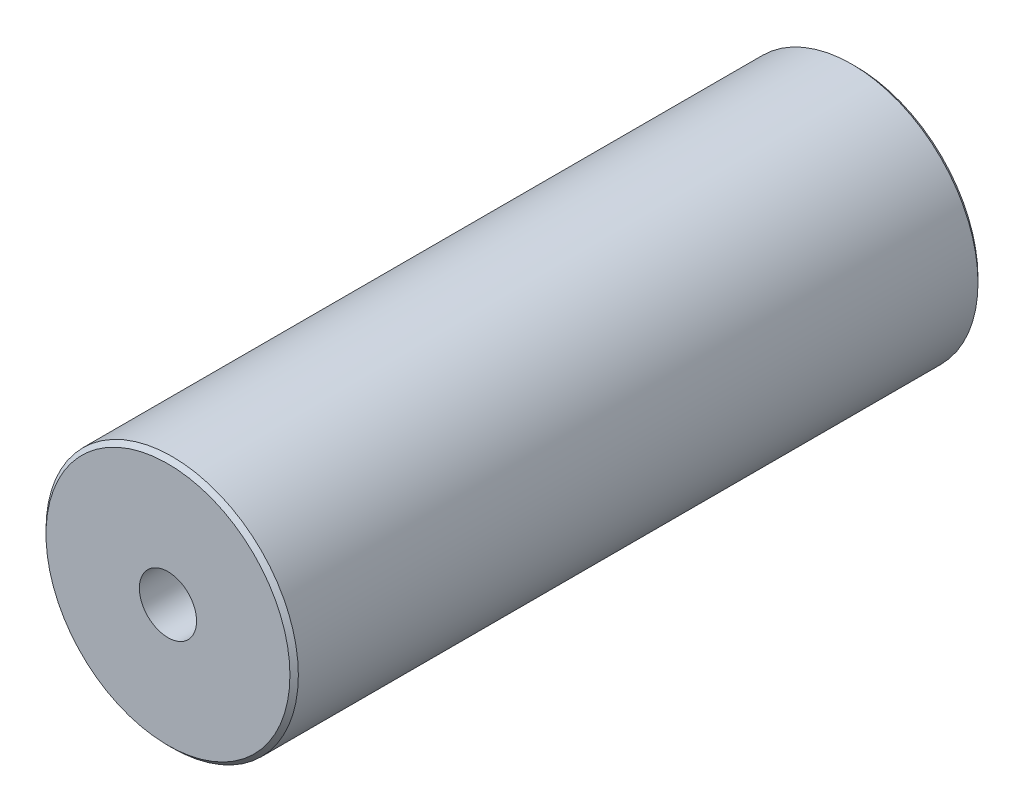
ISO-10303-21;
HEADER;
FILE_DESCRIPTION(('STEP AP214'),'2;1');
FILE_NAME('part.step','',(''),(''),'','','');
FILE_SCHEMA(('AUTOMOTIVE_DESIGN { 1 0 10303 214 1 1 1 1 }'));
ENDSEC;
DATA;
#1=APPLICATION_CONTEXT('core data for automotive mechanical design processes');
#2=APPLICATION_PROTOCOL_DEFINITION('international standard','automotive_design',2000,#1);
#3=PRODUCT_CONTEXT('',#1,'mechanical');
#4=PRODUCT('Part','Part','',(#3));
#5=PRODUCT_RELATED_PRODUCT_CATEGORY('part','',(#4));
#6=PRODUCT_DEFINITION_FORMATION('','',#4);
#7=PRODUCT_DEFINITION_CONTEXT('part definition',#1,'design');
#8=PRODUCT_DEFINITION('design','',#6,#7);
#9=PRODUCT_DEFINITION_SHAPE('','',#8);
#10=(LENGTH_UNIT() NAMED_UNIT(*) SI_UNIT(.MILLI.,.METRE.));
#11=(NAMED_UNIT(*) PLANE_ANGLE_UNIT() SI_UNIT($,.RADIAN.));
#12=(NAMED_UNIT(*) SI_UNIT($,.STERADIAN.) SOLID_ANGLE_UNIT());
#13=UNCERTAINTY_MEASURE_WITH_UNIT(LENGTH_MEASURE(1.E-05),#10,'distance_accuracy_value','');
#14=(GEOMETRIC_REPRESENTATION_CONTEXT(3) GLOBAL_UNCERTAINTY_ASSIGNED_CONTEXT((#13)) GLOBAL_UNIT_ASSIGNED_CONTEXT((#10,
#11,#12)) REPRESENTATION_CONTEXT('',''));
#15=CARTESIAN_POINT('',(0.,0.,0.));
#16=DIRECTION('',(0.,0.,1.));
#17=DIRECTION('',(1.,0.,0.));
#18=AXIS2_PLACEMENT_3D('',#15,#16,#17);
#19=CARTESIAN_POINT('',(0.,0.,40.9));
#20=DIRECTION('',(0.,0.,-1.));
#21=DIRECTION('',(-1.,0.,0.));
#22=AXIS2_PLACEMENT_3D('',#19,#20,#21);
#23=CYLINDRICAL_SURFACE('',#22,15.);
#24=CARTESIAN_POINT('',(0.,0.,40.4));
#25=DIRECTION('',(0.,0.,1.));
#26=DIRECTION('',(1.,0.,0.));
#27=AXIS2_PLACEMENT_3D('',#24,#25,#26);
#28=CIRCLE('',#27,15.);
#29=CARTESIAN_POINT('',(15.,0.,40.4));
#30=VERTEX_POINT('',#29);
#31=EDGE_CURVE('E355',#30,#30,#28,.F.);
#32=ORIENTED_EDGE('',*,*,#31,.T.);
#33=EDGE_LOOP('',(#32));
#34=FACE_BOUND('',#33,.T.);
#35=CARTESIAN_POINT('',(0.,0.,-40.4));
#36=DIRECTION('',(0.,0.,1.));
#37=DIRECTION('',(1.,0.,0.));
#38=AXIS2_PLACEMENT_3D('',#35,#36,#37);
#39=CIRCLE('',#38,15.);
#40=CARTESIAN_POINT('',(15.,0.,-40.4));
#41=VERTEX_POINT('',#40);
#42=EDGE_CURVE('E384',#41,#41,#39,.T.);
#43=ORIENTED_EDGE('',*,*,#42,.T.);
#44=EDGE_LOOP('',(#43));
#45=FACE_BOUND('',#44,.T.);
#46=ADVANCED_FACE('F348',(#34,#45),#23,.T.);
#47=CARTESIAN_POINT('',(0.,0.,40.9));
#48=DIRECTION('',(0.,0.,1.));
#49=DIRECTION('',(1.,0.,0.));
#50=AXIS2_PLACEMENT_3D('',#47,#48,#49);
#51=PLANE('',#50);
#52=CARTESIAN_POINT('',(0.,0.,40.9));
#53=DIRECTION('',(0.,0.,1.));
#54=DIRECTION('',(1.,0.,0.));
#55=AXIS2_PLACEMENT_3D('',#52,#53,#54);
#56=CIRCLE('',#55,3.4);
#57=CARTESIAN_POINT('',(3.4,0.,40.9));
#58=VERTEX_POINT('',#57);
#59=EDGE_CURVE('E378',#58,#58,#56,.T.);
#60=ORIENTED_EDGE('',*,*,#59,.F.);
#61=EDGE_LOOP('',(#60));
#62=FACE_BOUND('',#61,.T.);
#63=CARTESIAN_POINT('',(0.,0.,40.9));
#64=DIRECTION('',(0.,0.,1.));
#65=DIRECTION('',(1.,0.,0.));
#66=AXIS2_PLACEMENT_3D('',#63,#64,#65);
#67=CIRCLE('',#66,14.5);
#68=CARTESIAN_POINT('',(14.5,0.,40.9));
#69=VERTEX_POINT('',#68);
#70=EDGE_CURVE('E381',#69,#69,#67,.T.);
#71=ORIENTED_EDGE('',*,*,#70,.T.);
#72=EDGE_LOOP('',(#71));
#73=FACE_BOUND('',#72,.T.);
#74=ADVANCED_FACE('F399',(#62,#73),#51,.T.);
#75=CARTESIAN_POINT('',(0.,0.,-40.9));
#76=DIRECTION('',(0.,0.,1.));
#77=DIRECTION('',(1.,0.,0.));
#78=AXIS2_PLACEMENT_3D('',#75,#76,#77);
#79=PLANE('',#78);
#80=CARTESIAN_POINT('',(0.,0.,-40.9));
#81=DIRECTION('',(0.,0.,-1.));
#82=DIRECTION('',(-1.,0.,0.));
#83=AXIS2_PLACEMENT_3D('',#80,#81,#82);
#84=CIRCLE('',#83,3.39999999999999);
#85=CARTESIAN_POINT('',(-3.39999999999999,0.,-40.9));
#86=VERTEX_POINT('',#85);
#87=EDGE_CURVE('E370',#86,#86,#84,.T.);
#88=ORIENTED_EDGE('',*,*,#87,.F.);
#89=EDGE_LOOP('',(#88));
#90=FACE_BOUND('',#89,.T.);
#91=CARTESIAN_POINT('',(0.,0.,-40.9));
#92=DIRECTION('',(0.,0.,1.));
#93=DIRECTION('',(1.,0.,0.));
#94=AXIS2_PLACEMENT_3D('',#91,#92,#93);
#95=CIRCLE('',#94,14.5);
#96=CARTESIAN_POINT('',(14.5,0.,-40.9));
#97=VERTEX_POINT('',#96);
#98=EDGE_CURVE('E11',#97,#97,#95,.F.);
#99=ORIENTED_EDGE('',*,*,#98,.T.);
#100=EDGE_LOOP('',(#99));
#101=FACE_BOUND('',#100,.T.);
#102=ADVANCED_FACE('F395',(#90,#101),#79,.F.);
#103=CARTESIAN_POINT('',(0.,0.,40.9));
#104=DIRECTION('',(0.,0.,-1.));
#105=DIRECTION('',(-1.,0.,0.));
#106=AXIS2_PLACEMENT_3D('',#103,#104,#105);
#107=CONICAL_SURFACE('',#106,14.5,0.78539816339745);
#108=ORIENTED_EDGE('',*,*,#31,.F.);
#109=EDGE_LOOP('',(#108));
#110=FACE_BOUND('',#109,.T.);
#111=ORIENTED_EDGE('',*,*,#70,.F.);
#112=EDGE_LOOP('',(#111));
#113=FACE_BOUND('',#112,.T.);
#114=ADVANCED_FACE('F391',(#110,#113),#107,.T.);
#115=CARTESIAN_POINT('',(0.,0.,-40.4));
#116=DIRECTION('',(0.,0.,1.));
#117=DIRECTION('',(1.,0.,0.));
#118=AXIS2_PLACEMENT_3D('',#115,#116,#117);
#119=CONICAL_SURFACE('',#118,15.,0.78539816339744);
#120=ORIENTED_EDGE('',*,*,#98,.F.);
#121=EDGE_LOOP('',(#120));
#122=FACE_BOUND('',#121,.T.);
#123=ORIENTED_EDGE('',*,*,#42,.F.);
#124=EDGE_LOOP('',(#123));
#125=FACE_BOUND('',#124,.T.);
#126=ADVANCED_FACE('F394',(#122,#125),#119,.T.);
#127=CARTESIAN_POINT('',(0.,0.,40.9));
#128=DIRECTION('',(0.,0.,1.));
#129=DIRECTION('',(1.,0.,0.));
#130=AXIS2_PLACEMENT_3D('',#127,#128,#129);
#131=CYLINDRICAL_SURFACE('',#130,3.4);
#132=CARTESIAN_POINT('',(0.,0.,18.65));
#133=DIRECTION('',(0.,0.,1.));
#134=DIRECTION('',(1.,0.,0.));
#135=AXIS2_PLACEMENT_3D('',#132,#133,#134);
#136=CIRCLE('',#135,3.4);
#137=CARTESIAN_POINT('',(3.4,0.,18.65));
#138=VERTEX_POINT('',#137);
#139=EDGE_CURVE('E373',#138,#138,#136,.T.);
#140=ORIENTED_EDGE('',*,*,#139,.F.);
#141=EDGE_LOOP('',(#140));
#142=FACE_BOUND('',#141,.T.);
#143=ORIENTED_EDGE('',*,*,#59,.T.);
#144=EDGE_LOOP('',(#143));
#145=FACE_BOUND('',#144,.T.);
#146=ADVANCED_FACE('F413',(#142,#145),#131,.F.);
#147=CARTESIAN_POINT('',(0.,0.,18.65));
#148=DIRECTION('',(0.,0.,1.));
#149=DIRECTION('',(1.,0.,0.));
#150=AXIS2_PLACEMENT_3D('',#147,#148,#149);
#151=CONICAL_SURFACE('',#150,3.4,1.02974425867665);
#152=CARTESIAN_POINT('',(0.,0.,16.6070738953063));
#153=VERTEX_POINT('',#152);
#154=VERTEX_LOOP('',#153);
#155=FACE_BOUND('',#154,.T.);
#156=ORIENTED_EDGE('',*,*,#139,.T.);
#157=EDGE_LOOP('',(#156));
#158=FACE_BOUND('',#157,.T.);
#159=ADVANCED_FACE('F417',(#155,#158),#151,.F.);
#160=CARTESIAN_POINT('',(0.,0.,-40.9));
#161=DIRECTION('',(0.,0.,-1.));
#162=DIRECTION('',(-1.,0.,0.));
#163=AXIS2_PLACEMENT_3D('',#160,#161,#162);
#164=CYLINDRICAL_SURFACE('',#163,3.39999999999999);
#165=CARTESIAN_POINT('',(0.,0.,-18.65));
#166=DIRECTION('',(0.,0.,-1.));
#167=DIRECTION('',(-1.,0.,0.));
#168=AXIS2_PLACEMENT_3D('',#165,#166,#167);
#169=CIRCLE('',#168,3.39999999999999);
#170=CARTESIAN_POINT('',(-3.39999999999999,0.,-18.65));
#171=VERTEX_POINT('',#170);
#172=EDGE_CURVE('E368',#171,#171,#169,.T.);
#173=ORIENTED_EDGE('',*,*,#172,.F.);
#174=EDGE_LOOP('',(#173));
#175=FACE_BOUND('',#174,.T.);
#176=ORIENTED_EDGE('',*,*,#87,.T.);
#177=EDGE_LOOP('',(#176));
#178=FACE_BOUND('',#177,.T.);
#179=ADVANCED_FACE('F364',(#175,#178),#164,.F.);
#180=CARTESIAN_POINT('',(0.,0.,-18.65));
#181=DIRECTION('',(0.,0.,-1.));
#182=DIRECTION('',(-1.,0.,0.));
#183=AXIS2_PLACEMENT_3D('',#180,#181,#182);
#184=CONICAL_SURFACE('',#183,3.39999999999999,1.02974425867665);
#185=CARTESIAN_POINT('',(0.,0.,-16.6070738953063));
#186=VERTEX_POINT('',#185);
#187=VERTEX_LOOP('',#186);
#188=FACE_BOUND('',#187,.T.);
#189=ORIENTED_EDGE('',*,*,#172,.T.);
#190=EDGE_LOOP('',(#189));
#191=FACE_BOUND('',#190,.T.);
#192=ADVANCED_FACE('F361',(#188,#191),#184,.F.);
#193=CLOSED_SHELL('',(#46,#74,#102,#114,#126,#146,#159,#179,#192));
#194=MANIFOLD_SOLID_BREP('B2',#193);
#195=ADVANCED_BREP_SHAPE_REPRESENTATION('',(#18,#194),#14);
#196=SHAPE_DEFINITION_REPRESENTATION(#9,#195);
ENDSEC;
END-ISO-10303-21;
